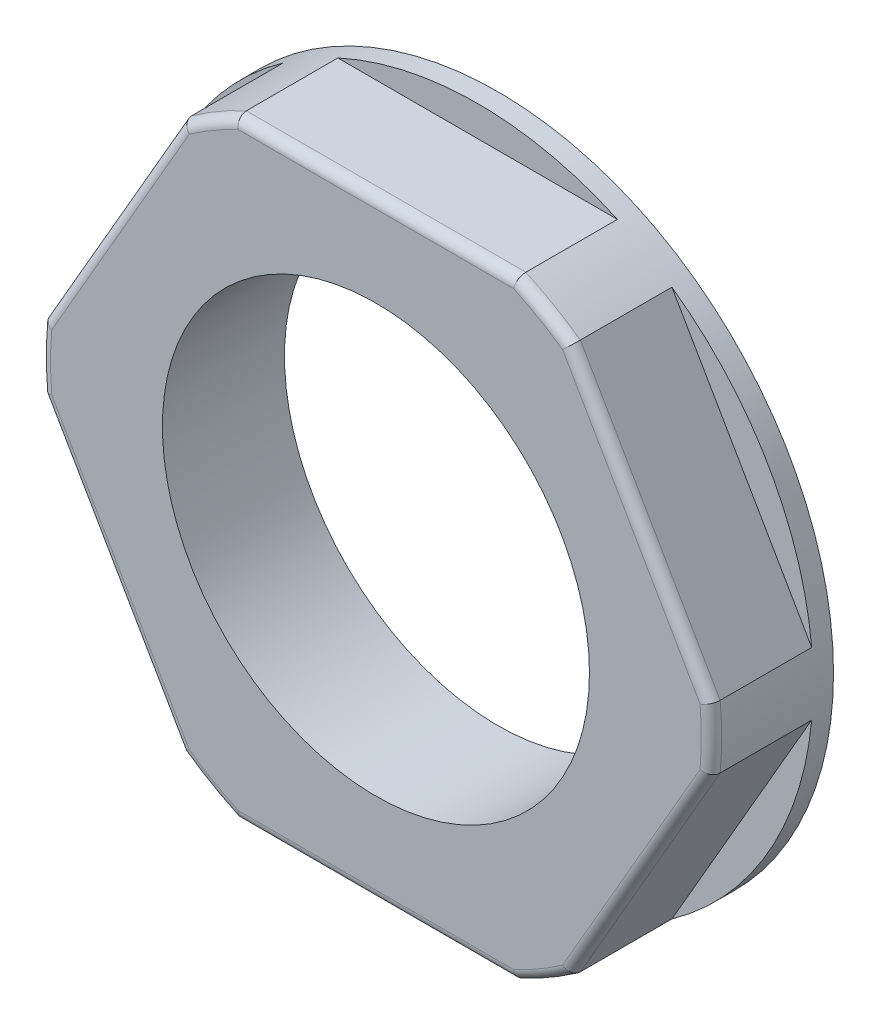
from build123d import *

# Parameters (mm, degrees)
ESQUISSE1_R             = 16.5
ESQUISSE1_R_2           = 10.5
BASE_EXTRUSION_DEPTH    = 6
ESQUISSE2_R             = 20
ENL_V_MAT_EXTRU_1_DEPTH = 5
CONG_1_R                = 0.5


with BuildPart() as part:
    # Esquisse1 → Base-Extrusion (new body)
    with BuildSketch(Plane.XY):
        with Locations(Location((0, 0, 0), (0, 0, 185.380022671))):
            Circle(ESQUISSE1_R)
        Circle(ESQUISSE1_R_2, mode=Mode.SUBTRACT)
    extrude(amount=BASE_EXTRUSION_DEPTH)

    # Esquisse2 → Enl_v. mat.-Extru.1 (cut)
    with BuildSketch(Plane.XY.offset(6)):
        Circle(ESQUISSE2_R)
        Polygon((8.660254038, 15), (-8.660254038, 15), (-17.320508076, 0), (-8.660254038, -15), (8.660254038, -15), (17.320508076, 0), align=None, mode=Mode.SUBTRACT)
    extrude(amount=-ENL_V_MAT_EXTRU_1_DEPTH, mode=Mode.SUBTRACT)

    # Cong_1
    cong_1_edges = [part.edges().sort_by_distance(p)[0] for p in [
        (-16.5, 0, 6),
        (-8.25, 14.289419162, 6),
        (8.25, 14.289419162, 6),
        (16.5, 0, 6),
        (8.25, -14.289419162, 6),
        (-8.25, -14.289419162, 6),
        (-12.990381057, -7.5, 6),
        (-12.990381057, 7.5, 6),
        (0, 15, 6),
        (12.990381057, 7.5, 6),
        (12.990381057, -7.5, 6),
        (0, -15, 6),
    ]]
    fillet(cong_1_edges, radius=CONG_1_R)


solid = part.part
